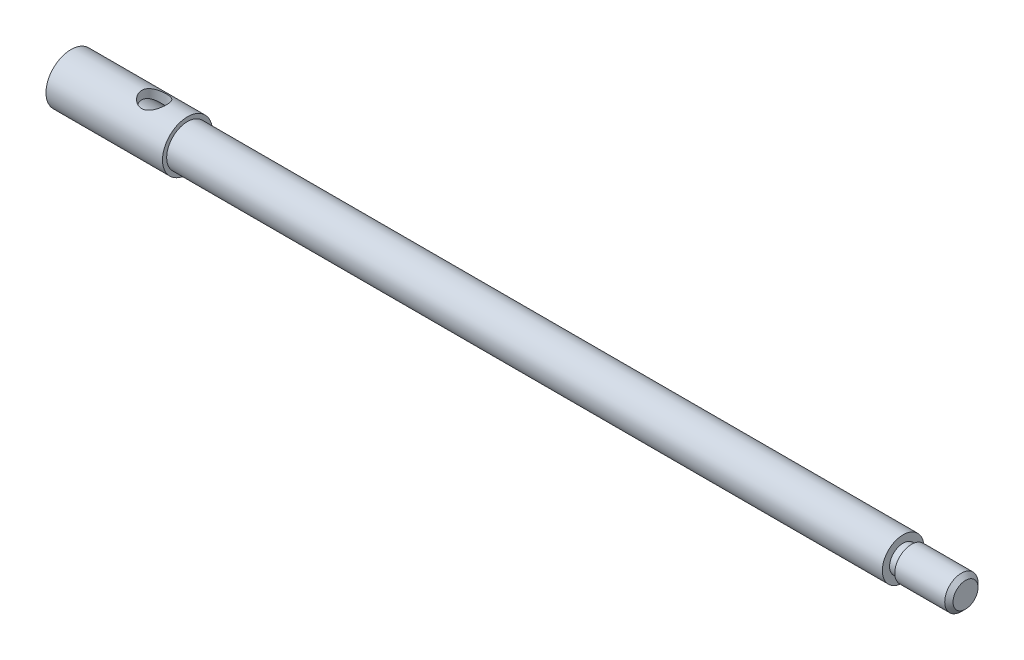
ISO-10303-21;
HEADER;
FILE_DESCRIPTION(('STEP AP214'),'2;1');
FILE_NAME('part.step','',(''),(''),'','','');
FILE_SCHEMA(('AUTOMOTIVE_DESIGN { 1 0 10303 214 1 1 1 1 }'));
ENDSEC;
DATA;
#1=APPLICATION_CONTEXT('core data for automotive mechanical design processes');
#2=APPLICATION_PROTOCOL_DEFINITION('international standard','automotive_design',2000,#1);
#3=PRODUCT_CONTEXT('',#1,'mechanical');
#4=PRODUCT('Part','Part','',(#3));
#5=PRODUCT_RELATED_PRODUCT_CATEGORY('part','',(#4));
#6=PRODUCT_DEFINITION_FORMATION('','',#4);
#7=PRODUCT_DEFINITION_CONTEXT('part definition',#1,'design');
#8=PRODUCT_DEFINITION('design','',#6,#7);
#9=PRODUCT_DEFINITION_SHAPE('','',#8);
#10=(LENGTH_UNIT() NAMED_UNIT(*) SI_UNIT(.MILLI.,.METRE.));
#11=(NAMED_UNIT(*) PLANE_ANGLE_UNIT() SI_UNIT($,.RADIAN.));
#12=(NAMED_UNIT(*) SI_UNIT($,.STERADIAN.) SOLID_ANGLE_UNIT());
#13=UNCERTAINTY_MEASURE_WITH_UNIT(LENGTH_MEASURE(1.E-05),#10,'distance_accuracy_value','');
#14=(GEOMETRIC_REPRESENTATION_CONTEXT(3) GLOBAL_UNCERTAINTY_ASSIGNED_CONTEXT((#13)) GLOBAL_UNIT_ASSIGNED_CONTEXT((#10,
#11,#12)) REPRESENTATION_CONTEXT('',''));
#15=CARTESIAN_POINT('',(0.,0.,0.));
#16=DIRECTION('',(0.,0.,1.));
#17=DIRECTION('',(1.,0.,0.));
#18=AXIS2_PLACEMENT_3D('',#15,#16,#17);
#19=CARTESIAN_POINT('',(-111.03964875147,0.,0.));
#20=DIRECTION('',(1.,0.,0.));
#21=DIRECTION('',(0.,0.,-1.));
#22=AXIS2_PLACEMENT_3D('',#19,#20,#21);
#23=PLANE('',#22);
#24=CARTESIAN_POINT('',(-111.03964875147,0.,0.));
#25=DIRECTION('',(-1.,0.,0.));
#26=DIRECTION('',(0.,0.,1.));
#27=AXIS2_PLACEMENT_3D('',#24,#25,#26);
#28=CIRCLE('',#27,4.);
#29=CARTESIAN_POINT('',(-111.03964875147,0.,4.));
#30=VERTEX_POINT('',#29);
#31=EDGE_CURVE('E59',#30,#30,#28,.T.);
#32=ORIENTED_EDGE('',*,*,#31,.F.);
#33=EDGE_LOOP('',(#32));
#34=FACE_BOUND('',#33,.T.);
#35=CARTESIAN_POINT('',(-111.03964875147,0.,0.));
#36=DIRECTION('',(-1.,0.,0.));
#37=DIRECTION('',(0.,0.,1.));
#38=AXIS2_PLACEMENT_3D('',#35,#36,#37);
#39=CIRCLE('',#38,6.);
#40=CARTESIAN_POINT('',(-111.03964875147,0.,6.));
#41=VERTEX_POINT('',#40);
#42=EDGE_CURVE('E83',#41,#41,#39,.T.);
#43=ORIENTED_EDGE('',*,*,#42,.T.);
#44=EDGE_LOOP('',(#43));
#45=FACE_BOUND('',#44,.T.);
#46=ADVANCED_FACE('F38',(#34,#45),#23,.F.);
#47=CARTESIAN_POINT('',(-111.03964875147,0.,0.));
#48=DIRECTION('',(-1.,0.,0.));
#49=DIRECTION('',(0.,0.,1.));
#50=AXIS2_PLACEMENT_3D('',#47,#48,#49);
#51=CYLINDRICAL_SURFACE('',#50,6.);
#52=CARTESIAN_POINT('',(-94.03964875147,-6.,0.));
#53=CARTESIAN_POINT('',(-94.0396479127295,-5.99999934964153,0.0788941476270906));
#54=CARTESIAN_POINT('',(-94.0365308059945,-5.99843869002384,0.157796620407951));
#55=CARTESIAN_POINT('',(-94.0241094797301,-5.99224358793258,0.315001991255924));
#56=CARTESIAN_POINT('',(-94.0148024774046,-5.98760776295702,0.393304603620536));
#57=CARTESIAN_POINT('',(-93.9776908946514,-5.96921978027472,0.626628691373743));
#58=CARTESIAN_POINT('',(-93.9406959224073,-5.95098734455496,0.779952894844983));
#59=CARTESIAN_POINT('',(-93.8440669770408,-5.90448966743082,1.07683586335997));
#60=CARTESIAN_POINT('',(-93.7845209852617,-5.87626344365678,1.22043005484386));
#61=CARTESIAN_POINT('',(-93.6449375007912,-5.81237302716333,1.49540820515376));
#62=CARTESIAN_POINT('',(-93.5649016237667,-5.77670942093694,1.62679312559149));
#63=CARTESIAN_POINT('',(-93.3810947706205,-5.69868752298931,1.88252701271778));
#64=CARTESIAN_POINT('',(-93.2761808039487,-5.65605474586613,2.0059694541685));
#65=CARTESIAN_POINT('',(-93.0480928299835,-5.5698003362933,2.23433451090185));
#66=CARTESIAN_POINT('',(-92.9249050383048,-5.52617797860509,2.33924301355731));
#67=CARTESIAN_POINT('',(-92.6521643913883,-5.43896347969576,2.53576864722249));
#68=CARTESIAN_POINT('',(-92.5013077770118,-5.39563602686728,2.62572411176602));
#69=CARTESIAN_POINT('',(-92.2636978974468,-5.33782449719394,2.74034031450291));
#70=CARTESIAN_POINT('',(-92.1825778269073,-5.31974570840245,2.77516786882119));
#71=CARTESIAN_POINT('',(-92.0170481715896,-5.28665768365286,2.83769299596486));
#72=CARTESIAN_POINT('',(-91.9326405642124,-5.27164663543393,2.86539478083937));
#73=CARTESIAN_POINT('',(-91.7662529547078,-5.24610341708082,2.91188280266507));
#74=CARTESIAN_POINT('',(-91.6844259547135,-5.23535838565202,2.93110042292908));
#75=CARTESIAN_POINT('',(-91.5190938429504,-5.21757784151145,2.96263559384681));
#76=CARTESIAN_POINT('',(-91.4355896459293,-5.21054036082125,2.9749568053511));
#77=CARTESIAN_POINT('',(-91.2676423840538,-5.20047756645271,2.99251382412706));
#78=CARTESIAN_POINT('',(-91.1831999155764,-5.19744983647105,2.99775389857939));
#79=CARTESIAN_POINT('',(-91.0141550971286,-5.19552555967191,3.00108452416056));
#80=CARTESIAN_POINT('',(-90.9295527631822,-5.19662861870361,2.99917575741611));
#81=CARTESIAN_POINT('',(-90.6968948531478,-5.20534668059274,2.98404973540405));
#82=CARTESIAN_POINT('',(-90.5494045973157,-5.21726794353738,2.96335042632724));
#83=CARTESIAN_POINT('',(-90.260455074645,-5.25228182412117,2.90082280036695));
#84=CARTESIAN_POINT('',(-90.1189977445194,-5.27537800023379,2.85898775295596));
#85=CARTESIAN_POINT('',(-89.8419691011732,-5.33062568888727,2.75462843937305));
#86=CARTESIAN_POINT('',(-89.7066116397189,-5.36297559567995,2.69164495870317));
#87=CARTESIAN_POINT('',(-89.447743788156,-5.43310175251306,2.547125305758));
#88=CARTESIAN_POINT('',(-89.3242387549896,-5.4708804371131,2.46558080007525));
#89=CARTESIAN_POINT('',(-89.0760856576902,-5.55339485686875,2.27419808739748));
#90=CARTESIAN_POINT('',(-88.9532783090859,-5.59840533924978,2.16208335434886));
#91=CARTESIAN_POINT('',(-88.727442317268,-5.68642866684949,1.91866675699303));
#92=CARTESIAN_POINT('',(-88.6244231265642,-5.72944054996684,1.7873557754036));
#93=CARTESIAN_POINT('',(-88.4365918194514,-5.81105962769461,1.50154951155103));
#94=CARTESIAN_POINT('',(-88.3528473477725,-5.84936952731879,1.34626077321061));
#95=CARTESIAN_POINT('',(-88.2133576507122,-5.91473643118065,1.02139864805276));
#96=CARTESIAN_POINT('',(-88.1575901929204,-5.94180236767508,0.851836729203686));
#97=CARTESIAN_POINT('',(-88.0802225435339,-5.97973001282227,0.518299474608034));
#98=CARTESIAN_POINT('',(-88.0561750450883,-5.99174814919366,0.355024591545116));
#99=CARTESIAN_POINT('',(-88.0352545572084,-6.00219040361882,0.0263387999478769));
#100=CARTESIAN_POINT('',(-88.0383686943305,-6.00062096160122,-0.139071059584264));
#101=CARTESIAN_POINT('',(-88.0702688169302,-5.98473576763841,-0.453698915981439));
#102=CARTESIAN_POINT('',(-88.097046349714,-5.97141737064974,-0.603178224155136));
#103=CARTESIAN_POINT('',(-88.1723629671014,-5.93466513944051,-0.895220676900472));
#104=CARTESIAN_POINT('',(-88.2209044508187,-5.91123019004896,-1.03778305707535));
#105=CARTESIAN_POINT('',(-88.3396441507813,-5.85552754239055,-1.31666582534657));
#106=CARTESIAN_POINT('',(-88.4104219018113,-5.82302645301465,-1.45269119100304));
#107=CARTESIAN_POINT('',(-88.5709713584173,-5.75231922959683,-1.71138408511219));
#108=CARTESIAN_POINT('',(-88.6607511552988,-5.71411066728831,-1.83404588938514));
#109=CARTESIAN_POINT('',(-88.8669300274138,-5.63124663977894,-2.07530306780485));
#110=CARTESIAN_POINT('',(-88.9850773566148,-5.58632654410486,-2.19231623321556));
#111=CARTESIAN_POINT('',(-89.2394242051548,-5.49787174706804,-2.40556896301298));
#112=CARTESIAN_POINT('',(-89.3756361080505,-5.4543380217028,-2.50179415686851));
#113=CARTESIAN_POINT('',(-89.6705797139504,-5.37153576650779,-2.675123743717));
#114=CARTESIAN_POINT('',(-89.8300825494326,-5.33257588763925,-2.75107648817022));
#115=CARTESIAN_POINT('',(-90.1621789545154,-5.26722216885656,-2.87424847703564));
#116=CARTESIAN_POINT('',(-90.3347553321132,-5.24081214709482,-2.92150474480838));
#117=CARTESIAN_POINT('',(-90.6703794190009,-5.20684503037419,-2.98158506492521));
#118=CARTESIAN_POINT('',(-90.8327515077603,-5.19772150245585,-2.99727899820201));
#119=CARTESIAN_POINT('',(-91.1579899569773,-5.19496064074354,-3.00206745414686));
#120=CARTESIAN_POINT('',(-91.3208560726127,-5.20131659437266,-2.99117350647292));
#121=CARTESIAN_POINT('',(-91.6260992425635,-5.22713585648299,-2.94577840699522));
#122=CARTESIAN_POINT('',(-91.7689501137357,-5.24529281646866,-2.91362505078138));
#123=CARTESIAN_POINT('',(-92.0470731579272,-5.29113050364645,-2.8295259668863));
#124=CARTESIAN_POINT('',(-92.182342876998,-5.31881429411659,-2.77757387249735));
#125=CARTESIAN_POINT('',(-92.4515231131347,-5.38285583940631,-2.65144766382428));
#126=CARTESIAN_POINT('',(-92.5847317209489,-5.41967139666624,-2.57601505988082));
#127=CARTESIAN_POINT('',(-92.8374730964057,-5.49706022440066,-2.40645126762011));
#128=CARTESIAN_POINT('',(-92.9569986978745,-5.5376354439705,-2.3123103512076));
#129=CARTESIAN_POINT('',(-93.1940716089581,-5.62386853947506,-2.09461689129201));
#130=CARTESIAN_POINT('',(-93.3096138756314,-5.66954494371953,-1.9688805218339));
#131=CARTESIAN_POINT('',(-93.518449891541,-5.75633712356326,-1.69843715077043));
#132=CARTESIAN_POINT('',(-93.6117316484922,-5.79745043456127,-1.55371998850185));
#133=CARTESIAN_POINT('',(-93.7328269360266,-5.85251406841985,-1.32452333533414));
#134=CARTESIAN_POINT('',(-93.7701689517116,-5.86982524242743,-1.24575314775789));
#135=CARTESIAN_POINT('',(-93.8380104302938,-5.90168845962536,-1.08479725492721));
#136=CARTESIAN_POINT('',(-93.8685132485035,-5.91624185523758,-1.00261324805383));
#137=CARTESIAN_POINT('',(-93.9222560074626,-5.94212690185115,-0.835616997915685));
#138=CARTESIAN_POINT('',(-93.945511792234,-5.95346557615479,-0.750810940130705));
#139=CARTESIAN_POINT('',(-93.9845313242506,-5.97260771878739,-0.57914235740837));
#140=CARTESIAN_POINT('',(-94.0002996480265,-5.98041334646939,-0.492281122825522));
#141=CARTESIAN_POINT('',(-94.0213334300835,-5.99085829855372,-0.337824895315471));
#142=CARTESIAN_POINT('',(-94.028195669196,-5.99428035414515,-0.270495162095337));
#143=CARTESIAN_POINT('',(-94.0373537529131,-5.99885151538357,-0.135445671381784));
#144=CARTESIAN_POINT('',(-94.0396494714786,-6.00000055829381,-0.0677259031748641));
#145=CARTESIAN_POINT('',(-94.03964875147,-6.,0.));
#146=B_SPLINE_CURVE_WITH_KNOTS('',3,(#52,#53,#54,#55,#56,#57,#58,#59,#60,#61,#62,#63,#64,#65,
#66,#67,#68,#69,#70,#71,#72,#73,#74,#75,#76,#77,#78,#79,#80,#81,#82,#83,#84,#85,#86,#87,#88,#89,
#90,#91,#92,#93,#94,#95,#96,#97,#98,#99,#100,#101,#102,#103,#104,#105,#106,#107,#108,#109,#110,
#111,#112,#113,#114,#115,#116,#117,#118,#119,#120,#121,#122,#123,#124,#125,#126,#127,#128,#129,
#130,#131,#132,#133,#134,#135,#136,#137,#138,#139,#140,#141,#142,#143,#144,#145),.UNSPECIFIED.,
.T.,.F.,(4,2,2,2,2,2,2,2,2,2,2,2,2,2,2,2,2,2,2,2,2,2,2,2,2,2,2,2,2,2,2,2,2,2,2,2,2,2,2,2,2,2,2,
2,2,2,4),(0.,0.236611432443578,0.473329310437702,0.947100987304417,1.41904300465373,
1.89094781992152,2.39140181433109,2.89223525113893,3.43190833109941,3.70192714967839,
3.97178599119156,4.22563720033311,4.47935352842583,4.73291689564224,4.98645606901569,
5.43238672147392,5.8784594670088,6.33492255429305,6.79159098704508,7.30616358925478,
7.82098138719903,8.35970601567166,8.89800185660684,9.39171406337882,9.88519228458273,
10.3404225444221,10.7957029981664,11.2640010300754,11.7324988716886,12.2470036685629,
12.7618630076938,13.3016558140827,13.8407507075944,14.3280945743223,14.8152271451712,
15.2559532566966,15.6968212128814,16.1673090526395,16.6380421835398,17.1659726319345,
17.694186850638,17.9605054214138,18.2266930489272,18.4922945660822,18.7577335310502,
18.9608446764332,19.1639614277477),.UNSPECIFIED.);
#147=CARTESIAN_POINT('',(-94.03964875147,-6.,0.));
#148=VERTEX_POINT('',#147);
#149=EDGE_CURVE('E65',#148,#148,#146,.T.);
#150=ORIENTED_EDGE('',*,*,#149,.T.);
#151=EDGE_LOOP('',(#150));
#152=FACE_BOUND('',#151,.T.);
#153=CARTESIAN_POINT('',(-91.03964875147,5.19615242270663,3.00000000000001));
#154=CARTESIAN_POINT('',(-91.1178489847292,5.19615338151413,2.99999910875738));
#155=CARTESIAN_POINT('',(-91.1960587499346,5.19792581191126,2.99693611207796));
#156=CARTESIAN_POINT('',(-91.3518568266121,5.20493931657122,2.9847356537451));
#157=CARTESIAN_POINT('',(-91.4294448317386,5.21018200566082,2.97559536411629));
#158=CARTESIAN_POINT('',(-91.6605927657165,5.23088200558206,2.93916912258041));
#159=CARTESIAN_POINT('',(-91.8123996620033,5.25131076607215,2.90287805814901));
#160=CARTESIAN_POINT('',(-92.1060403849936,5.30247746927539,2.80829998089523));
#161=CARTESIAN_POINT('',(-92.2479225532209,5.33316051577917,2.75012989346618));
#162=CARTESIAN_POINT('',(-92.5199115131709,5.40128072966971,2.61380253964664));
#163=CARTESIAN_POINT('',(-92.6500176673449,5.43871826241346,2.53564419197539));
#164=CARTESIAN_POINT('',(-92.9065688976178,5.51990583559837,2.35399963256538));
#165=CARTESIAN_POINT('',(-93.031826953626,5.5639218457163,2.24895611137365));
#166=CARTESIAN_POINT('',(-93.2638731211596,5.65115954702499,2.01976141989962));
#167=CARTESIAN_POINT('',(-93.3706520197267,5.69438083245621,1.89560077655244));
#168=CARTESIAN_POINT('',(-93.5697504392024,5.77864428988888,1.62146869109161));
#169=CARTESIAN_POINT('',(-93.6606101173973,5.81934318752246,1.47032156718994));
#170=CARTESIAN_POINT('',(-93.8150712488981,5.89052268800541,1.15247107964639));
#171=CARTESIAN_POINT('',(-93.8786899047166,5.92100973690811,0.985777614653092));
#172=CARTESIAN_POINT('',(-93.9721627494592,5.96641383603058,0.654134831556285));
#173=CARTESIAN_POINT('',(-94.0040973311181,5.98228440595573,0.489905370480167));
#174=CARTESIAN_POINT('',(-94.0401471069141,6.00022751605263,0.157711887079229));
#175=CARTESIAN_POINT('',(-94.0442791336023,6.00230840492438,-0.0102498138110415));
#176=CARTESIAN_POINT('',(-94.0254087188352,5.9928894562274,-0.329497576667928));
#177=CARTESIAN_POINT('',(-94.004734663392,5.98255487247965,-0.480963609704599));
#178=CARTESIAN_POINT('',(-93.9410062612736,5.9512273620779,-0.777941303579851));
#179=CARTESIAN_POINT('',(-93.8979502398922,5.93023363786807,-0.923452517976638));
#180=CARTESIAN_POINT('',(-93.7904008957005,5.87914748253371,-1.20692822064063));
#181=CARTESIAN_POINT('',(-93.7256192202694,5.84893318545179,-1.34476044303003));
#182=CARTESIAN_POINT('',(-93.5768590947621,5.78212944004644,-1.60793023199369));
#183=CARTESIAN_POINT('',(-93.4928737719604,5.74553771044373,-1.73326330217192));
#184=CARTESIAN_POINT('',(-93.2989602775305,5.66533158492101,-1.98052168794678));
#185=CARTESIAN_POINT('',(-93.1873302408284,5.62138031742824,-2.10100497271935));
#186=CARTESIAN_POINT('',(-92.9458890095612,5.53363118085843,-2.32231036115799));
#187=CARTESIAN_POINT('',(-92.8160639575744,5.48983345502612,-2.42311733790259));
#188=CARTESIAN_POINT('',(-92.5316666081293,5.40432084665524,-2.60852695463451));
#189=CARTESIAN_POINT('',(-92.3760463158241,5.36291485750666,-2.69169402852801));
#190=CARTESIAN_POINT('',(-92.1320856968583,5.30915194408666,-2.79542837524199));
#191=CARTESIAN_POINT('',(-92.0489924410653,5.29261946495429,-2.82650797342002));
#192=CARTESIAN_POINT('',(-91.8798401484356,5.26298473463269,-2.88131297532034));
#193=CARTESIAN_POINT('',(-91.7937829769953,5.24988036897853,-2.90504291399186));
#194=CARTESIAN_POINT('',(-91.626277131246,5.22855455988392,-2.94323927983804));
#195=CARTESIAN_POINT('',(-91.5449993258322,5.22002982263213,-2.95828810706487));
#196=CARTESIAN_POINT('',(-91.3812135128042,5.2067273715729,-2.98163903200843));
#197=CARTESIAN_POINT('',(-91.2987061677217,5.20194770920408,-2.98994463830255));
#198=CARTESIAN_POINT('',(-91.1331777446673,5.19633662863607,-2.99968663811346));
#199=CARTESIAN_POINT('',(-91.0501568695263,5.19550374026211,-3.00112558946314));
#200=CARTESIAN_POINT('',(-90.8843622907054,5.19780953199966,-2.99712742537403));
#201=CARTESIAN_POINT('',(-90.8015885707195,5.20094794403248,-2.99169077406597));
#202=CARTESIAN_POINT('',(-90.5727896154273,5.21504493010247,-2.96710135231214));
#203=CARTESIAN_POINT('',(-90.4277379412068,5.23019160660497,-2.9405616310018));
#204=CARTESIAN_POINT('',(-90.1445178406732,5.27081666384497,-2.8670906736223));
#205=CARTESIAN_POINT('',(-90.0063516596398,5.29629839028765,-2.82015283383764));
#206=CARTESIAN_POINT('',(-89.7334226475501,5.35608780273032,-2.70494224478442));
#207=CARTESIAN_POINT('',(-89.5991138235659,5.3907496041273,-2.63578205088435));
#208=CARTESIAN_POINT('',(-89.343238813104,5.46468327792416,-2.47886133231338));
#209=CARTESIAN_POINT('',(-89.2216792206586,5.50395751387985,-2.39109125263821));
#210=CARTESIAN_POINT('',(-88.9787131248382,5.58864005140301,-2.186511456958));
#211=CARTESIAN_POINT('',(-88.85925748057,5.63419752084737,-2.067435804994));
#212=CARTESIAN_POINT('',(-88.6414118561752,5.72202702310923,-1.81021349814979));
#213=CARTESIAN_POINT('',(-88.5430289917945,5.76429794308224,-1.67206042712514));
#214=CARTESIAN_POINT('',(-88.3679276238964,5.84224085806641,-1.37560608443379));
#215=CARTESIAN_POINT('',(-88.2918494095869,5.87770925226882,-1.21686929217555));
#216=CARTESIAN_POINT('',(-88.1682350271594,5.93650064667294,-0.886567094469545));
#217=CARTESIAN_POINT('',(-88.1206737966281,5.95983430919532,-0.715013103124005));
#218=CARTESIAN_POINT('',(-88.0595430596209,5.9900252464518,-0.380939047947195));
#219=CARTESIAN_POINT('',(-88.0432551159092,5.99819783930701,-0.219034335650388));
#220=CARTESIAN_POINT('',(-88.0371189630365,6.00126390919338,0.105377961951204));
#221=CARTESIAN_POINT('',(-88.0472614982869,5.99616203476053,0.267885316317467));
#222=CARTESIAN_POINT('',(-88.0918979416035,5.97401907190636,0.577613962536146));
#223=CARTESIAN_POINT('',(-88.1247431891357,5.95778686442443,0.725136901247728));
#224=CARTESIAN_POINT('',(-88.2116298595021,5.91576278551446,1.01233790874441));
#225=CARTESIAN_POINT('',(-88.2656743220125,5.88996954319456,1.15201484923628));
#226=CARTESIAN_POINT('',(-88.3958294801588,5.82977801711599,1.42627001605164));
#227=CARTESIAN_POINT('',(-88.4727850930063,5.79505887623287,1.56037465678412));
#228=CARTESIAN_POINT('',(-88.6455241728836,5.72064363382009,1.81432469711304));
#229=CARTESIAN_POINT('',(-88.7413162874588,5.6809452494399,1.93416350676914));
#230=CARTESIAN_POINT('',(-88.9600334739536,5.59585978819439,2.16873884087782));
#231=CARTESIAN_POINT('',(-89.0847100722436,5.55029975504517,2.28178066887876));
#232=CARTESIAN_POINT('',(-89.3520270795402,5.46188649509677,2.48600225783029));
#233=CARTESIAN_POINT('',(-89.4946832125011,5.41903568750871,2.57716267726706));
#234=CARTESIAN_POINT('',(-89.7221805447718,5.36004774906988,2.6966555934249));
#235=CARTESIAN_POINT('',(-89.8016245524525,5.34101219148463,2.73405408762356));
#236=CARTESIAN_POINT('',(-89.9640020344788,5.30572783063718,2.80191257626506));
#237=CARTESIAN_POINT('',(-90.0469336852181,5.28947759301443,2.83237614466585));
#238=CARTESIAN_POINT('',(-90.2154934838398,5.26045215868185,2.88592624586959));
#239=CARTESIAN_POINT('',(-90.3011140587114,5.2476680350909,2.90903175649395));
#240=CARTESIAN_POINT('',(-90.4745040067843,5.22608869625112,2.94762428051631));
#241=CARTESIAN_POINT('',(-90.5622718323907,5.21729069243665,2.96311662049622));
#242=CARTESIAN_POINT('',(-90.71504756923,5.20588528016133,2.98309381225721));
#243=CARTESIAN_POINT('',(-90.779743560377,5.20224442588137,2.98942746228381));
#244=CARTESIAN_POINT('',(-90.9095070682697,5.19737751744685,2.99788106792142));
#245=CARTESIAN_POINT('',(-90.9745746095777,5.19615162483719,3.00000074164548));
#246=CARTESIAN_POINT('',(-91.03964875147,5.19615242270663,3.00000000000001));
#247=B_SPLINE_CURVE_WITH_KNOTS('',3,(#153,#154,#155,#156,#157,#158,#159,#160,#161,#162,#163,
#164,#165,#166,#167,#168,#169,#170,#171,#172,#173,#174,#175,#176,#177,#178,#179,#180,#181,#182,
#183,#184,#185,#186,#187,#188,#189,#190,#191,#192,#193,#194,#195,#196,#197,#198,#199,#200,#201,
#202,#203,#204,#205,#206,#207,#208,#209,#210,#211,#212,#213,#214,#215,#216,#217,#218,#219,#220,
#221,#222,#223,#224,#225,#226,#227,#228,#229,#230,#231,#232,#233,#234,#235,#236,#237,#238,#239,
#240,#241,#242,#243,#244,#245,#246),.UNSPECIFIED.,.T.,.F.,(4,2,2,2,2,2,2,2,2,2,2,2,2,2,2,2,2,2,
2,2,2,2,2,2,2,2,2,2,2,2,2,2,2,2,2,2,2,2,2,2,2,2,2,2,2,2,4),(0.,0.234529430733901,
0.469168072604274,0.938850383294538,1.4060574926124,1.87328988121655,2.37905864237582,
2.88507883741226,3.42520847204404,3.96499651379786,4.46637625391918,4.96745241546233,
5.42495462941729,5.88249108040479,6.34635774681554,6.81039068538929,7.31828744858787,
7.82657315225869,8.36713695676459,8.63752916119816,8.9077541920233,9.15669600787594,
9.40550821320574,9.65422772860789,9.90293045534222,10.3454331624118,10.7880792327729,
11.2512265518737,11.7146122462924,12.2364099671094,12.7583836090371,13.29413310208,
13.8294110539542,14.3155757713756,14.8015702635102,15.2555404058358,15.7095756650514,
16.1830301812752,16.6567025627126,17.1775149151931,17.6987859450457,17.968011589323,
18.2370981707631,18.5054849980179,18.7736837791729,18.9688338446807,19.1639969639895),.UNSPECIFIED.);
#248=CARTESIAN_POINT('',(-91.03964875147,5.19615242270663,3.00000000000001));
#249=VERTEX_POINT('',#248);
#250=EDGE_CURVE('E108',#249,#249,#247,.T.);
#251=ORIENTED_EDGE('',*,*,#250,.T.);
#252=EDGE_LOOP('',(#251));
#253=FACE_BOUND('',#252,.T.);
#254=ORIENTED_EDGE('',*,*,#42,.F.);
#255=EDGE_LOOP('',(#254));
#256=FACE_BOUND('',#255,.T.);
#257=CARTESIAN_POINT('',(-83.03964875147,0.,0.));
#258=DIRECTION('',(-1.,0.,0.));
#259=DIRECTION('',(0.,0.,1.));
#260=AXIS2_PLACEMENT_3D('',#257,#258,#259);
#261=CIRCLE('',#260,6.);
#262=CARTESIAN_POINT('',(-83.03964875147,0.,6.));
#263=VERTEX_POINT('',#262);
#264=EDGE_CURVE('E80',#263,#263,#261,.T.);
#265=ORIENTED_EDGE('',*,*,#264,.T.);
#266=EDGE_LOOP('',(#265));
#267=FACE_BOUND('',#266,.T.);
#268=ADVANCED_FACE('F117',(#152,#253,#256,#267),#51,.T.);
#269=CARTESIAN_POINT('',(-83.03964875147,6.,0.));
#270=DIRECTION('',(-1.,0.,0.));
#271=DIRECTION('',(0.,0.,1.));
#272=AXIS2_PLACEMENT_3D('',#269,#270,#271);
#273=PLANE('',#272);
#274=ORIENTED_EDGE('',*,*,#264,.F.);
#275=EDGE_LOOP('',(#274));
#276=FACE_BOUND('',#275,.T.);
#277=CARTESIAN_POINT('',(-83.03964875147,0.,0.));
#278=DIRECTION('',(-1.,0.,0.));
#279=DIRECTION('',(0.,0.,1.));
#280=AXIS2_PLACEMENT_3D('',#277,#278,#279);
#281=CIRCLE('',#280,5.);
#282=CARTESIAN_POINT('',(-83.03964875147,0.,5.));
#283=VERTEX_POINT('',#282);
#284=EDGE_CURVE('E77',#283,#283,#281,.T.);
#285=ORIENTED_EDGE('',*,*,#284,.T.);
#286=EDGE_LOOP('',(#285));
#287=FACE_BOUND('',#286,.T.);
#288=ADVANCED_FACE('F121',(#276,#287),#273,.F.);
#289=CARTESIAN_POINT('',(-111.03964875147,0.,0.));
#290=DIRECTION('',(-1.,0.,0.));
#291=DIRECTION('',(0.,0.,1.));
#292=AXIS2_PLACEMENT_3D('',#289,#290,#291);
#293=CYLINDRICAL_SURFACE('',#292,5.);
#294=ORIENTED_EDGE('',*,*,#284,.F.);
#295=EDGE_LOOP('',(#294));
#296=FACE_BOUND('',#295,.T.);
#297=CARTESIAN_POINT('',(88.9603512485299,0.,0.));
#298=DIRECTION('',(-1.,0.,0.));
#299=DIRECTION('',(0.,0.,1.));
#300=AXIS2_PLACEMENT_3D('',#297,#298,#299);
#301=CIRCLE('',#300,5.);
#302=CARTESIAN_POINT('',(88.9603512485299,0.,5.));
#303=VERTEX_POINT('',#302);
#304=EDGE_CURVE('E74',#303,#303,#301,.T.);
#305=ORIENTED_EDGE('',*,*,#304,.T.);
#306=EDGE_LOOP('',(#305));
#307=FACE_BOUND('',#306,.T.);
#308=ADVANCED_FACE('F138',(#296,#307),#293,.T.);
#309=CARTESIAN_POINT('',(88.9603512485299,5.,0.));
#310=DIRECTION('',(-1.,0.,0.));
#311=DIRECTION('',(0.,0.,1.));
#312=AXIS2_PLACEMENT_3D('',#309,#310,#311);
#313=PLANE('',#312);
#314=ORIENTED_EDGE('',*,*,#304,.F.);
#315=EDGE_LOOP('',(#314));
#316=FACE_BOUND('',#315,.T.);
#317=CARTESIAN_POINT('',(88.96035124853,0.,0.));
#318=DIRECTION('',(-1.,0.,0.));
#319=DIRECTION('',(0.,0.,1.));
#320=AXIS2_PLACEMENT_3D('',#317,#318,#319);
#321=CIRCLE('',#320,3.25);
#322=CARTESIAN_POINT('',(88.96035124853,0.,3.25));
#323=VERTEX_POINT('',#322);
#324=EDGE_CURVE('E71',#323,#323,#321,.T.);
#325=ORIENTED_EDGE('',*,*,#324,.T.);
#326=EDGE_LOOP('',(#325));
#327=FACE_BOUND('',#326,.T.);
#328=ADVANCED_FACE('F143',(#316,#327),#313,.F.);
#329=CARTESIAN_POINT('',(-111.03964875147,0.,0.));
#330=DIRECTION('',(-1.,0.,0.));
#331=DIRECTION('',(0.,0.,1.));
#332=AXIS2_PLACEMENT_3D('',#329,#330,#331);
#333=CYLINDRICAL_SURFACE('',#332,3.25);
#334=ORIENTED_EDGE('',*,*,#324,.F.);
#335=EDGE_LOOP('',(#334));
#336=FACE_BOUND('',#335,.T.);
#337=CARTESIAN_POINT('',(90.96035124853,0.,0.));
#338=DIRECTION('',(-1.,0.,0.));
#339=DIRECTION('',(0.,0.,1.));
#340=AXIS2_PLACEMENT_3D('',#337,#338,#339);
#341=CIRCLE('',#340,3.25);
#342=CARTESIAN_POINT('',(90.96035124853,0.,3.25));
#343=VERTEX_POINT('',#342);
#344=EDGE_CURVE('E62',#343,#343,#341,.T.);
#345=ORIENTED_EDGE('',*,*,#344,.T.);
#346=EDGE_LOOP('',(#345));
#347=FACE_BOUND('',#346,.T.);
#348=ADVANCED_FACE('F148',(#336,#347),#333,.T.);
#349=CARTESIAN_POINT('',(90.96035124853,3.25,0.));
#350=DIRECTION('',(1.,0.,0.));
#351=DIRECTION('',(0.,0.,-1.));
#352=AXIS2_PLACEMENT_3D('',#349,#350,#351);
#353=PLANE('',#352);
#354=ORIENTED_EDGE('',*,*,#344,.F.);
#355=EDGE_LOOP('',(#354));
#356=FACE_BOUND('',#355,.T.);
#357=CARTESIAN_POINT('',(90.96035124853,0.,0.));
#358=DIRECTION('',(-1.,0.,0.));
#359=DIRECTION('',(0.,0.,1.));
#360=AXIS2_PLACEMENT_3D('',#357,#358,#359);
#361=CIRCLE('',#360,4.);
#362=CARTESIAN_POINT('',(90.96035124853,0.,4.));
#363=VERTEX_POINT('',#362);
#364=EDGE_CURVE('E58',#363,#363,#361,.T.);
#365=ORIENTED_EDGE('',*,*,#364,.T.);
#366=EDGE_LOOP('',(#365));
#367=FACE_BOUND('',#366,.T.);
#368=ADVANCED_FACE('F154',(#356,#367),#353,.F.);
#369=CARTESIAN_POINT('',(-111.03964875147,0.,0.));
#370=DIRECTION('',(-1.,0.,0.));
#371=DIRECTION('',(0.,0.,1.));
#372=AXIS2_PLACEMENT_3D('',#369,#370,#371);
#373=CYLINDRICAL_SURFACE('',#372,4.);
#374=CARTESIAN_POINT('',(102.96035124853,0.,0.));
#375=DIRECTION('',(-1.,0.,0.));
#376=DIRECTION('',(0.,0.,1.));
#377=AXIS2_PLACEMENT_3D('',#374,#375,#376);
#378=CIRCLE('',#377,4.);
#379=CARTESIAN_POINT('',(102.96035124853,0.,4.));
#380=VERTEX_POINT('',#379);
#381=EDGE_CURVE('E45',#380,#380,#378,.T.);
#382=ORIENTED_EDGE('',*,*,#381,.T.);
#383=EDGE_LOOP('',(#382));
#384=FACE_BOUND('',#383,.T.);
#385=ORIENTED_EDGE('',*,*,#364,.F.);
#386=EDGE_LOOP('',(#385));
#387=FACE_BOUND('',#386,.T.);
#388=ADVANCED_FACE('F160',(#384,#387),#373,.T.);
#389=CARTESIAN_POINT('',(103.96035124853,4.,0.));
#390=DIRECTION('',(-1.,0.,0.));
#391=DIRECTION('',(0.,0.,1.));
#392=AXIS2_PLACEMENT_3D('',#389,#390,#391);
#393=PLANE('',#392);
#394=CARTESIAN_POINT('',(103.96035124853,0.,0.));
#395=DIRECTION('',(-1.,0.,0.));
#396=DIRECTION('',(0.,0.,1.));
#397=AXIS2_PLACEMENT_3D('',#394,#395,#396);
#398=CIRCLE('',#397,3.00000000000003);
#399=CARTESIAN_POINT('',(103.96035124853,0.,3.00000000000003));
#400=VERTEX_POINT('',#399);
#401=EDGE_CURVE('E11',#400,#400,#398,.F.);
#402=ORIENTED_EDGE('',*,*,#401,.T.);
#403=EDGE_LOOP('',(#402));
#404=FACE_BOUND('',#403,.T.);
#405=ADVANCED_FACE('F52',(#404),#393,.F.);
#406=CARTESIAN_POINT('',(-86.0396487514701,0.,0.));
#407=DIRECTION('',(-1.,0.,0.));
#408=DIRECTION('',(0.,0.,1.));
#409=AXIS2_PLACEMENT_3D('',#406,#407,#408);
#410=CONICAL_SURFACE('',#409,4.,1.02974425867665);
#411=CARTESIAN_POINT('',(-83.6362062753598,0.,0.));
#412=VERTEX_POINT('',#411);
#413=VERTEX_LOOP('',#412);
#414=FACE_BOUND('',#413,.T.);
#415=CARTESIAN_POINT('',(-86.0396487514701,0.,0.));
#416=DIRECTION('',(-1.,0.,0.));
#417=DIRECTION('',(0.,0.,1.));
#418=AXIS2_PLACEMENT_3D('',#415,#416,#417);
#419=CIRCLE('',#418,4.);
#420=CARTESIAN_POINT('',(-86.0396487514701,0.,4.));
#421=VERTEX_POINT('',#420);
#422=EDGE_CURVE('E56',#421,#421,#419,.T.);
#423=ORIENTED_EDGE('',*,*,#422,.T.);
#424=EDGE_LOOP('',(#423));
#425=FACE_BOUND('',#424,.T.);
#426=ADVANCED_FACE('F48',(#414,#425),#410,.F.);
#427=CARTESIAN_POINT('',(-111.03964875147,0.,0.));
#428=DIRECTION('',(-1.,0.,0.));
#429=DIRECTION('',(0.,0.,1.));
#430=AXIS2_PLACEMENT_3D('',#427,#428,#429);
#431=CYLINDRICAL_SURFACE('',#430,4.);
#432=CARTESIAN_POINT('',(-91.03964875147,-2.64575131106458,3.00000000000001));
#433=CARTESIAN_POINT('',(-91.1096887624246,-2.64574551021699,3.00000280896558));
#434=CARTESIAN_POINT('',(-91.1797063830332,-2.64854755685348,2.99754094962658));
#435=CARTESIAN_POINT('',(-91.3189871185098,-2.65954937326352,2.98778335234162));
#436=CARTESIAN_POINT('',(-91.3882499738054,-2.66775094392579,2.98048600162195));
#437=CARTESIAN_POINT('',(-91.5941613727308,-2.69984445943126,2.95155901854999));
#438=CARTESIAN_POINT('',(-91.7287226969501,-2.73122303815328,2.92289529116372));
#439=CARTESIAN_POINT('',(-91.9868468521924,-2.80749414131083,2.84967902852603));
#440=CARTESIAN_POINT('',(-92.1105358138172,-2.85219424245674,2.80535116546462));
#441=CARTESIAN_POINT('',(-92.348330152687,-2.94973182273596,2.70261160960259));
#442=CARTESIAN_POINT('',(-92.4624366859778,-3.00256831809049,2.64420161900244));
#443=CARTESIAN_POINT('',(-92.7038738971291,-3.12354326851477,2.50080271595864));
#444=CARTESIAN_POINT('',(-92.8289687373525,-3.19256884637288,2.41280926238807));
#445=CARTESIAN_POINT('',(-93.0647155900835,-3.33043252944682,2.21865412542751));
#446=CARTESIAN_POINT('',(-93.175345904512,-3.3992702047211,2.11246568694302));
#447=CARTESIAN_POINT('',(-93.3396518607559,-3.50539769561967,1.92836490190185));
#448=CARTESIAN_POINT('',(-93.3984982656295,-3.54435965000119,1.85597029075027));
#449=CARTESIAN_POINT('',(-93.5097942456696,-3.6193818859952,1.70504181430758));
#450=CARTESIAN_POINT('',(-93.5622467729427,-3.6554435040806,1.62651080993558));
#451=CARTESIAN_POINT('',(-93.6600626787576,-3.72361957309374,1.46370409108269));
#452=CARTESIAN_POINT('',(-93.7054370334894,-3.75574011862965,1.37943756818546));
#453=CARTESIAN_POINT('',(-93.7884340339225,-3.81509912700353,1.20559494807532));
#454=CARTESIAN_POINT('',(-93.8260607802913,-3.84234017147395,1.11602169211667));
#455=CARTESIAN_POINT('',(-93.9060278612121,-3.90065407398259,0.895799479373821));
#456=CARTESIAN_POINT('',(-93.9443532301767,-3.92898588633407,0.762908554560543));
#457=CARTESIAN_POINT('',(-94.0024386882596,-3.97212104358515,0.491088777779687));
#458=CARTESIAN_POINT('',(-94.0222149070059,-3.98693614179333,0.352165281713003));
#459=CARTESIAN_POINT('',(-94.0420896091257,-4.00182527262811,0.0717346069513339));
#460=CARTESIAN_POINT('',(-94.0421369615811,-4.00186100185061,-0.0697783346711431));
#461=CARTESIAN_POINT('',(-94.0224135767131,-3.9870847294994,-0.350633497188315));
#462=CARTESIAN_POINT('',(-94.0026382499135,-3.97226928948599,-0.489975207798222));
#463=CARTESIAN_POINT('',(-93.9454864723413,-3.92982740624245,-0.757778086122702));
#464=CARTESIAN_POINT('',(-93.9087360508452,-3.9026571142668,-0.886448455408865));
#465=CARTESIAN_POINT('',(-93.8196575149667,-3.83764561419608,-1.13536105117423));
#466=CARTESIAN_POINT('',(-93.7673260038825,-3.79980207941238,-1.25560143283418));
#467=CARTESIAN_POINT('',(-93.6425895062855,-3.71122090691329,-1.49843381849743));
#468=CARTESIAN_POINT('',(-93.5686245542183,-3.65953080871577,-1.61987076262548));
#469=CARTESIAN_POINT('',(-93.4061813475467,-3.54921405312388,-1.84913450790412));
#470=CARTESIAN_POINT('',(-93.3176907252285,-3.49058149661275,-1.95694957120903));
#471=CARTESIAN_POINT('',(-93.1092020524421,-3.35787531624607,-2.17816408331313));
#472=CARTESIAN_POINT('',(-92.9864303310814,-3.28303311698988,-2.28848985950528));
#473=CARTESIAN_POINT('',(-92.7239795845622,-3.13451916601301,-2.48801751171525));
#474=CARTESIAN_POINT('',(-92.5842925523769,-3.06084798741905,-2.57720932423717));
#475=CARTESIAN_POINT('',(-92.3176850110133,-2.93638851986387,-2.7174641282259));
#476=CARTESIAN_POINT('',(-92.1936746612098,-2.88395199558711,-2.77257733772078));
#477=CARTESIAN_POINT('',(-91.9355181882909,-2.79073482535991,-2.86638794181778));
#478=CARTESIAN_POINT('',(-91.8013957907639,-2.74992790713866,-2.9051224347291));
#479=CARTESIAN_POINT('',(-91.5522748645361,-2.69280101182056,-2.95804770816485));
#480=CARTESIAN_POINT('',(-91.438754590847,-2.67323078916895,-2.97558139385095));
#481=CARTESIAN_POINT('',(-91.2089378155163,-2.64871177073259,-2.9974352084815));
#482=CARTESIAN_POINT('',(-91.0926450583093,-2.6437442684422,-3.00177224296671));
#483=CARTESIAN_POINT('',(-90.8606907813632,-2.64925736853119,-2.99690541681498));
#484=CARTESIAN_POINT('',(-90.7450295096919,-2.65974365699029,-2.98769657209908));
#485=CARTESIAN_POINT('',(-90.5174963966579,-2.6944244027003,-2.95645049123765));
#486=CARTESIAN_POINT('',(-90.4056313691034,-2.71864225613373,-2.93439135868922));
#487=CARTESIAN_POINT('',(-90.1469729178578,-2.78855502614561,-2.86827946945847));
#488=CARTESIAN_POINT('',(-90.0027779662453,-2.83889586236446,-2.81908501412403));
#489=CARTESIAN_POINT('',(-89.7270322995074,-2.95075783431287,-2.70177633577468));
#490=CARTESIAN_POINT('',(-89.5955054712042,-3.01229948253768,-2.63362727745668));
#491=CARTESIAN_POINT('',(-89.3409551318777,-3.14216325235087,-2.47740025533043));
#492=CARTESIAN_POINT('',(-89.2183996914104,-3.21064858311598,-2.3887003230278));
#493=CARTESIAN_POINT('',(-88.9876278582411,-3.34695922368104,-2.19363312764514));
#494=CARTESIAN_POINT('',(-88.8794184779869,-3.41478419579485,-2.08725728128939));
#495=CARTESIAN_POINT('',(-88.7181166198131,-3.51957077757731,-1.9023981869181));
#496=CARTESIAN_POINT('',(-88.6599906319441,-3.55825033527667,-1.82922305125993));
#497=CARTESIAN_POINT('',(-88.5502106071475,-3.63258399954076,-1.67675777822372));
#498=CARTESIAN_POINT('',(-88.4985535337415,-3.66823952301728,-1.59747053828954));
#499=CARTESIAN_POINT('',(-88.4024073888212,-3.7354872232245,-1.43317795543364));
#500=CARTESIAN_POINT('',(-88.3579086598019,-3.76708486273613,-1.34818053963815));
#501=CARTESIAN_POINT('',(-88.276765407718,-3.82527474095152,-1.17294532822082));
#502=CARTESIAN_POINT('',(-88.2401166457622,-3.85186968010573,-1.08271039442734));
#503=CARTESIAN_POINT('',(-88.1628092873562,-3.90835673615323,-0.861573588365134));
#504=CARTESIAN_POINT('',(-88.1261449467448,-3.935501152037,-0.72851679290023));
#505=CARTESIAN_POINT('',(-88.0713813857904,-3.97621371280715,-0.456712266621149));
#506=CARTESIAN_POINT('',(-88.0532655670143,-3.98979399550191,-0.317969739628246));
#507=CARTESIAN_POINT('',(-88.0366185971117,-4.0022690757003,-0.0382996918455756));
#508=CARTESIAN_POINT('',(-88.0381334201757,-4.00112939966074,0.102632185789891));
#509=CARTESIAN_POINT('',(-88.0607700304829,-3.98417666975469,0.382019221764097));
#510=CARTESIAN_POINT('',(-88.081897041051,-3.96835970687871,0.520473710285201));
#511=CARTESIAN_POINT('',(-88.1415987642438,-3.92406786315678,0.787043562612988));
#512=CARTESIAN_POINT('',(-88.179649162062,-3.8959737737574,0.915342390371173));
#513=CARTESIAN_POINT('',(-88.2712248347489,-3.82925445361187,1.1633227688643));
#514=CARTESIAN_POINT('',(-88.3247534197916,-3.79062697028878,1.28300246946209));
#515=CARTESIAN_POINT('',(-88.4522046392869,-3.70035282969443,1.5250953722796));
#516=CARTESIAN_POINT('',(-88.5277506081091,-3.64772704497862,1.64628246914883));
#517=CARTESIAN_POINT('',(-88.6933816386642,-3.53571013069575,1.87482962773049));
#518=CARTESIAN_POINT('',(-88.7834800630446,-3.47631279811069,1.98217681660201));
#519=CARTESIAN_POINT('',(-88.9956594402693,-3.34212703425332,2.20224762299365));
#520=CARTESIAN_POINT('',(-89.120541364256,-3.26661834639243,2.31183387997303));
#521=CARTESIAN_POINT('',(-89.3873850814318,-3.117321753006,2.50950501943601));
#522=CARTESIAN_POINT('',(-89.5293531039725,-3.04353448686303,2.59758202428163));
#523=CARTESIAN_POINT('',(-89.7974147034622,-2.92099172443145,2.73391957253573));
#524=CARTESIAN_POINT('',(-89.9203168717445,-2.87027147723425,2.78667101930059));
#525=CARTESIAN_POINT('',(-90.1758164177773,-2.78065231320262,2.87610746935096));
#526=CARTESIAN_POINT('',(-90.3083869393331,-2.74172209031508,2.91283513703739));
#527=CARTESIAN_POINT('',(-90.5412203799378,-2.69064580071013,2.95994243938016));
#528=CARTESIAN_POINT('',(-90.6395673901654,-2.67399401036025,2.97488911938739));
#529=CARTESIAN_POINT('',(-90.8385089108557,-2.65155449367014,2.99491264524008));
#530=CARTESIAN_POINT('',(-90.9391019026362,-2.6457596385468,2.99999596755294));
#531=CARTESIAN_POINT('',(-91.03964875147,-2.64575131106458,3.00000000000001));
#532=B_SPLINE_CURVE_WITH_KNOTS('',3,(#432,#433,#434,#435,#436,#437,#438,#439,#440,#441,#442,
#443,#444,#445,#446,#447,#448,#449,#450,#451,#452,#453,#454,#455,#456,#457,#458,#459,#460,#461,
#462,#463,#464,#465,#466,#467,#468,#469,#470,#471,#472,#473,#474,#475,#476,#477,#478,#479,#480,
#481,#482,#483,#484,#485,#486,#487,#488,#489,#490,#491,#492,#493,#494,#495,#496,#497,#498,#499,
#500,#501,#502,#503,#504,#505,#506,#507,#508,#509,#510,#511,#512,#513,#514,#515,#516,#517,#518,
#519,#520,#521,#522,#523,#524,#525,#526,#527,#528,#529,#530,#531),.UNSPECIFIED.,.T.,.F.,(4,2,2,
2,2,2,2,2,2,2,2,2,2,2,2,2,2,2,2,2,2,2,2,2,2,2,2,2,2,2,2,2,2,2,2,2,2,2,2,2,2,2,2,2,2,2,2,2,2,4),
(0.,0.209978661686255,0.4200273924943,0.840743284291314,1.2556546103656,1.67051580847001,
2.17226801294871,2.67476445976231,2.97770625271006,3.28050764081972,3.58283470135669,
3.88500133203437,4.30659768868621,4.72782710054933,5.15014819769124,5.57256709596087,
5.98051830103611,6.38855850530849,6.840780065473,7.29338868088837,7.83503352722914,
8.37693577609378,8.81203137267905,9.24613611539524,9.59420329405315,9.94182439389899,
10.2895734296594,10.6379167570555,11.1166437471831,11.5962564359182,12.0929073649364,
12.5898001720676,12.8928465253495,13.1957500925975,13.4982415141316,13.8005691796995,
14.2206053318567,14.6402652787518,15.060908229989,15.4816632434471,15.8902036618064,
16.2988315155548,16.7537484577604,17.2090855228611,17.7544990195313,18.3001119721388,
18.7279130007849,19.1545679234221,19.456203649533,19.7576412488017),.UNSPECIFIED.);
#533=CARTESIAN_POINT('',(-91.03964875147,-2.64575131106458,3.00000000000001));
#534=VERTEX_POINT('',#533);
#535=EDGE_CURVE('E94',#534,#534,#532,.T.);
#536=ORIENTED_EDGE('',*,*,#535,.T.);
#537=EDGE_LOOP('',(#536));
#538=FACE_BOUND('',#537,.T.);
#539=CARTESIAN_POINT('',(-91.03964875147,2.64575131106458,3.00000000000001));
#540=CARTESIAN_POINT('',(-90.9696087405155,2.64574551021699,3.00000280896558));
#541=CARTESIAN_POINT('',(-90.8995911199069,2.64854755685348,2.99754094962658));
#542=CARTESIAN_POINT('',(-90.7603103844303,2.65954937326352,2.98778335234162));
#543=CARTESIAN_POINT('',(-90.6910475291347,2.66775094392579,2.98048600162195));
#544=CARTESIAN_POINT('',(-90.4851361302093,2.69984445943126,2.95155901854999));
#545=CARTESIAN_POINT('',(-90.35057480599,2.73122303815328,2.92289529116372));
#546=CARTESIAN_POINT('',(-90.0924506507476,2.80749414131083,2.84967902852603));
#547=CARTESIAN_POINT('',(-89.9687616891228,2.85219424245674,2.80535116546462));
#548=CARTESIAN_POINT('',(-89.7309673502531,2.94973182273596,2.70261160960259));
#549=CARTESIAN_POINT('',(-89.6168608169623,3.00256831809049,2.64420161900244));
#550=CARTESIAN_POINT('',(-89.375423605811,3.12354326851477,2.50080271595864));
#551=CARTESIAN_POINT('',(-89.2503287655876,3.19256884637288,2.41280926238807));
#552=CARTESIAN_POINT('',(-89.0145819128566,3.33043252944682,2.21865412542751));
#553=CARTESIAN_POINT('',(-88.9039515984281,3.3992702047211,2.11246568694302));
#554=CARTESIAN_POINT('',(-88.7396456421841,3.50539769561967,1.92836490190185));
#555=CARTESIAN_POINT('',(-88.6807992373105,3.54435965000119,1.85597029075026));
#556=CARTESIAN_POINT('',(-88.5695032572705,3.6193818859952,1.70504181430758));
#557=CARTESIAN_POINT('',(-88.5170507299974,3.6554435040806,1.62651080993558));
#558=CARTESIAN_POINT('',(-88.4192348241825,3.72361957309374,1.46370409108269));
#559=CARTESIAN_POINT('',(-88.3738604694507,3.75574011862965,1.37943756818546));
#560=CARTESIAN_POINT('',(-88.2908634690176,3.81509912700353,1.20559494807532));
#561=CARTESIAN_POINT('',(-88.2532367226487,3.84234017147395,1.11602169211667));
#562=CARTESIAN_POINT('',(-88.173269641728,3.90065407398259,0.895799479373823));
#563=CARTESIAN_POINT('',(-88.1349442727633,3.92898588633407,0.762908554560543));
#564=CARTESIAN_POINT('',(-88.0768588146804,3.97212104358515,0.491088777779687));
#565=CARTESIAN_POINT('',(-88.0570825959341,3.98693614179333,0.352165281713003));
#566=CARTESIAN_POINT('',(-88.0372078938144,4.00182527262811,0.0717346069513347));
#567=CARTESIAN_POINT('',(-88.037160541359,4.00186100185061,-0.0697783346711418));
#568=CARTESIAN_POINT('',(-88.056883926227,3.9870847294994,-0.350633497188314));
#569=CARTESIAN_POINT('',(-88.0766592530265,3.97226928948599,-0.489975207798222));
#570=CARTESIAN_POINT('',(-88.1338110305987,3.92982740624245,-0.757778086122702));
#571=CARTESIAN_POINT('',(-88.1705614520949,3.9026571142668,-0.886448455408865));
#572=CARTESIAN_POINT('',(-88.2596399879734,3.83764561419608,-1.13536105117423));
#573=CARTESIAN_POINT('',(-88.3119714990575,3.79980207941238,-1.25560143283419));
#574=CARTESIAN_POINT('',(-88.4367079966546,3.71122090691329,-1.49843381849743));
#575=CARTESIAN_POINT('',(-88.5106729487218,3.65953080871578,-1.61987076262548));
#576=CARTESIAN_POINT('',(-88.6731161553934,3.54921405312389,-1.84913450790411));
#577=CARTESIAN_POINT('',(-88.7616067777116,3.49058149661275,-1.95694957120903));
#578=CARTESIAN_POINT('',(-88.970095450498,3.35787531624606,-2.17816408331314));
#579=CARTESIAN_POINT('',(-89.0928671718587,3.28303311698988,-2.28848985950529));
#580=CARTESIAN_POINT('',(-89.3553179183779,3.13451916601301,-2.48801751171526));
#581=CARTESIAN_POINT('',(-89.4950049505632,3.06084798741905,-2.57720932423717));
#582=CARTESIAN_POINT('',(-89.7616124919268,2.93638851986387,-2.7174641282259));
#583=CARTESIAN_POINT('',(-89.8856228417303,2.88395199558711,-2.77257733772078));
#584=CARTESIAN_POINT('',(-90.1437793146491,2.79073482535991,-2.86638794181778));
#585=CARTESIAN_POINT('',(-90.2779017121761,2.74992790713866,-2.9051224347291));
#586=CARTESIAN_POINT('',(-90.527022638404,2.69280101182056,-2.95804770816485));
#587=CARTESIAN_POINT('',(-90.6405429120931,2.67323078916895,-2.97558139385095));
#588=CARTESIAN_POINT('',(-90.8703596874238,2.64871177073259,-2.9974352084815));
#589=CARTESIAN_POINT('',(-90.9866524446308,2.6437442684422,-3.00177224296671));
#590=CARTESIAN_POINT('',(-91.2186067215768,2.64925736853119,-2.99690541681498));
#591=CARTESIAN_POINT('',(-91.3342679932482,2.6597436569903,-2.98769657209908));
#592=CARTESIAN_POINT('',(-91.5618011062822,2.6944244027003,-2.95645049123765));
#593=CARTESIAN_POINT('',(-91.6736661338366,2.71864225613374,-2.93439135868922));
#594=CARTESIAN_POINT('',(-91.9323245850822,2.78855502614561,-2.86827946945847));
#595=CARTESIAN_POINT('',(-92.0765195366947,2.83889586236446,-2.81908501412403));
#596=CARTESIAN_POINT('',(-92.3522652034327,2.95075783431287,-2.70177633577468));
#597=CARTESIAN_POINT('',(-92.4837920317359,3.01229948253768,-2.63362727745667));
#598=CARTESIAN_POINT('',(-92.7383423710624,3.14216325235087,-2.47740025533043));
#599=CARTESIAN_POINT('',(-92.8608978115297,3.21064858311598,-2.3887003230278));
#600=CARTESIAN_POINT('',(-93.091669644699,3.34695922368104,-2.19363312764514));
#601=CARTESIAN_POINT('',(-93.1998790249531,3.41478419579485,-2.08725728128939));
#602=CARTESIAN_POINT('',(-93.361180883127,3.51957077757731,-1.9023981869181));
#603=CARTESIAN_POINT('',(-93.419306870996,3.55825033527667,-1.82922305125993));
#604=CARTESIAN_POINT('',(-93.5290868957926,3.63258399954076,-1.67675777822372));
#605=CARTESIAN_POINT('',(-93.5807439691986,3.66823952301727,-1.59747053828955));
#606=CARTESIAN_POINT('',(-93.6768901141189,3.7354872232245,-1.43317795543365));
#607=CARTESIAN_POINT('',(-93.7213888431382,3.76708486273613,-1.34818053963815));
#608=CARTESIAN_POINT('',(-93.802532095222,3.82527474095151,-1.17294532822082));
#609=CARTESIAN_POINT('',(-93.8391808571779,3.85186968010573,-1.08271039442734));
#610=CARTESIAN_POINT('',(-93.9164882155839,3.90835673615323,-0.861573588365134));
#611=CARTESIAN_POINT('',(-93.9531525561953,3.935501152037,-0.728516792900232));
#612=CARTESIAN_POINT('',(-94.0079161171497,3.97621371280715,-0.456712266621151));
#613=CARTESIAN_POINT('',(-94.0260319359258,3.98979399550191,-0.317969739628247));
#614=CARTESIAN_POINT('',(-94.0426789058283,4.0022690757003,-0.0382996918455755));
#615=CARTESIAN_POINT('',(-94.0411640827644,4.00112939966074,0.102632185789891));
#616=CARTESIAN_POINT('',(-94.0185274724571,3.98417666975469,0.382019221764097));
#617=CARTESIAN_POINT('',(-93.9974004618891,3.96835970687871,0.520473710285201));
#618=CARTESIAN_POINT('',(-93.9376987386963,3.92406786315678,0.787043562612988));
#619=CARTESIAN_POINT('',(-93.8996483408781,3.8959737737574,0.915342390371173));
#620=CARTESIAN_POINT('',(-93.8080726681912,3.82925445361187,1.1633227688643));
#621=CARTESIAN_POINT('',(-93.7545440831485,3.79062697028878,1.28300246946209));
#622=CARTESIAN_POINT('',(-93.6270928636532,3.70035282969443,1.5250953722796));
#623=CARTESIAN_POINT('',(-93.551546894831,3.64772704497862,1.64628246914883));
#624=CARTESIAN_POINT('',(-93.3859158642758,3.53571013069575,1.87482962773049));
#625=CARTESIAN_POINT('',(-93.2958174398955,3.47631279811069,1.98217681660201));
#626=CARTESIAN_POINT('',(-93.0836380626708,3.34212703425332,2.20224762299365));
#627=CARTESIAN_POINT('',(-92.9587561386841,3.26661834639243,2.31183387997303));
#628=CARTESIAN_POINT('',(-92.6919124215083,3.117321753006,2.50950501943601));
#629=CARTESIAN_POINT('',(-92.5499443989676,3.04353448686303,2.59758202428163));
#630=CARTESIAN_POINT('',(-92.2818827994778,2.92099172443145,2.73391957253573));
#631=CARTESIAN_POINT('',(-92.1589806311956,2.87027147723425,2.78667101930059));
#632=CARTESIAN_POINT('',(-91.9034810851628,2.78065231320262,2.87610746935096));
#633=CARTESIAN_POINT('',(-91.770910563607,2.74172209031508,2.91283513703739));
#634=CARTESIAN_POINT('',(-91.5380771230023,2.69064580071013,2.95994243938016));
#635=CARTESIAN_POINT('',(-91.4397301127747,2.67399401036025,2.97488911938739));
#636=CARTESIAN_POINT('',(-91.2407885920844,2.65155449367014,2.99491264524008));
#637=CARTESIAN_POINT('',(-91.1401956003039,2.6457596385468,2.99999596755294));
#638=CARTESIAN_POINT('',(-91.03964875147,2.64575131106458,3.00000000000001));
#639=B_SPLINE_CURVE_WITH_KNOTS('',3,(#539,#540,#541,#542,#543,#544,#545,#546,#547,#548,#549,
#550,#551,#552,#553,#554,#555,#556,#557,#558,#559,#560,#561,#562,#563,#564,#565,#566,#567,#568,
#569,#570,#571,#572,#573,#574,#575,#576,#577,#578,#579,#580,#581,#582,#583,#584,#585,#586,#587,
#588,#589,#590,#591,#592,#593,#594,#595,#596,#597,#598,#599,#600,#601,#602,#603,#604,#605,#606,
#607,#608,#609,#610,#611,#612,#613,#614,#615,#616,#617,#618,#619,#620,#621,#622,#623,#624,#625,
#626,#627,#628,#629,#630,#631,#632,#633,#634,#635,#636,#637,#638),.UNSPECIFIED.,.T.,.F.,(4,2,2,
2,2,2,2,2,2,2,2,2,2,2,2,2,2,2,2,2,2,2,2,2,2,2,2,2,2,2,2,2,2,2,2,2,2,2,2,2,2,2,2,2,2,2,2,2,2,4),
(0.,0.209978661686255,0.4200273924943,0.840743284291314,1.2556546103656,1.67051580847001,
2.17226801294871,2.67476445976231,2.97770625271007,3.28050764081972,3.58283470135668,
3.88500133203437,4.30659768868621,4.72782710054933,5.15014819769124,5.57256709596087,
5.98051830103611,6.38855850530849,6.840780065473,7.29338868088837,7.83503352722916,
8.37693577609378,8.81203137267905,9.24613611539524,9.59420329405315,9.94182439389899,
10.2895734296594,10.6379167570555,11.1166437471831,11.5962564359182,12.0929073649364,
12.5898001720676,12.8928465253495,13.1957500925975,13.4982415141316,13.8005691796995,
14.2206053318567,14.6402652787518,15.060908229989,15.4816632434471,15.8902036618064,
16.2988315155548,16.7537484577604,17.2090855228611,17.7544990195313,18.3001119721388,
18.7279130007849,19.1545679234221,19.456203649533,19.7576412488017),.UNSPECIFIED.);
#640=CARTESIAN_POINT('',(-91.03964875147,2.64575131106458,3.00000000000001));
#641=VERTEX_POINT('',#640);
#642=EDGE_CURVE('E86',#641,#641,#639,.T.);
#643=ORIENTED_EDGE('',*,*,#642,.T.);
#644=EDGE_LOOP('',(#643));
#645=FACE_BOUND('',#644,.T.);
#646=ORIENTED_EDGE('',*,*,#422,.F.);
#647=EDGE_LOOP('',(#646));
#648=FACE_BOUND('',#647,.T.);
#649=ORIENTED_EDGE('',*,*,#31,.T.);
#650=EDGE_LOOP('',(#649));
#651=FACE_BOUND('',#650,.T.);
#652=ADVANCED_FACE('F51',(#538,#645,#648,#651),#431,.F.);
#653=CARTESIAN_POINT('',(-91.03964875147,-6.,0.));
#654=DIRECTION('',(0.,1.,0.));
#655=DIRECTION('',(0.,0.,1.));
#656=AXIS2_PLACEMENT_3D('',#653,#654,#655);
#657=CYLINDRICAL_SURFACE('',#656,3.00000000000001);
#658=ORIENTED_EDGE('',*,*,#642,.F.);
#659=EDGE_LOOP('',(#658));
#660=FACE_BOUND('',#659,.T.);
#661=ORIENTED_EDGE('',*,*,#250,.F.);
#662=EDGE_LOOP('',(#661));
#663=FACE_BOUND('',#662,.T.);
#664=ADVANCED_FACE('F102',(#660,#663),#657,.F.);
#665=ORIENTED_EDGE('',*,*,#535,.F.);
#666=EDGE_LOOP('',(#665));
#667=FACE_BOUND('',#666,.T.);
#668=ORIENTED_EDGE('',*,*,#149,.F.);
#669=EDGE_LOOP('',(#668));
#670=FACE_BOUND('',#669,.T.);
#671=ADVANCED_FACE('F99',(#667,#670),#657,.F.);
#672=CARTESIAN_POINT('',(102.96035124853,0.,0.));
#673=DIRECTION('',(-1.,0.,0.));
#674=DIRECTION('',(0.,0.,1.));
#675=AXIS2_PLACEMENT_3D('',#672,#673,#674);
#676=CONICAL_SURFACE('',#675,4.,0.785398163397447);
#677=ORIENTED_EDGE('',*,*,#401,.F.);
#678=EDGE_LOOP('',(#677));
#679=FACE_BOUND('',#678,.T.);
#680=ORIENTED_EDGE('',*,*,#381,.F.);
#681=EDGE_LOOP('',(#680));
#682=FACE_BOUND('',#681,.T.);
#683=ADVANCED_FACE('F40',(#679,#682),#676,.T.);
#684=CLOSED_SHELL('',(#46,#268,#288,#308,#328,#348,#368,#388,#405,#426,#652,#664,#671,#683));
#685=MANIFOLD_SOLID_BREP('B2',#684);
#686=ADVANCED_BREP_SHAPE_REPRESENTATION('',(#18,#685),#14);
#687=SHAPE_DEFINITION_REPRESENTATION(#9,#686);
ENDSEC;
END-ISO-10303-21;
